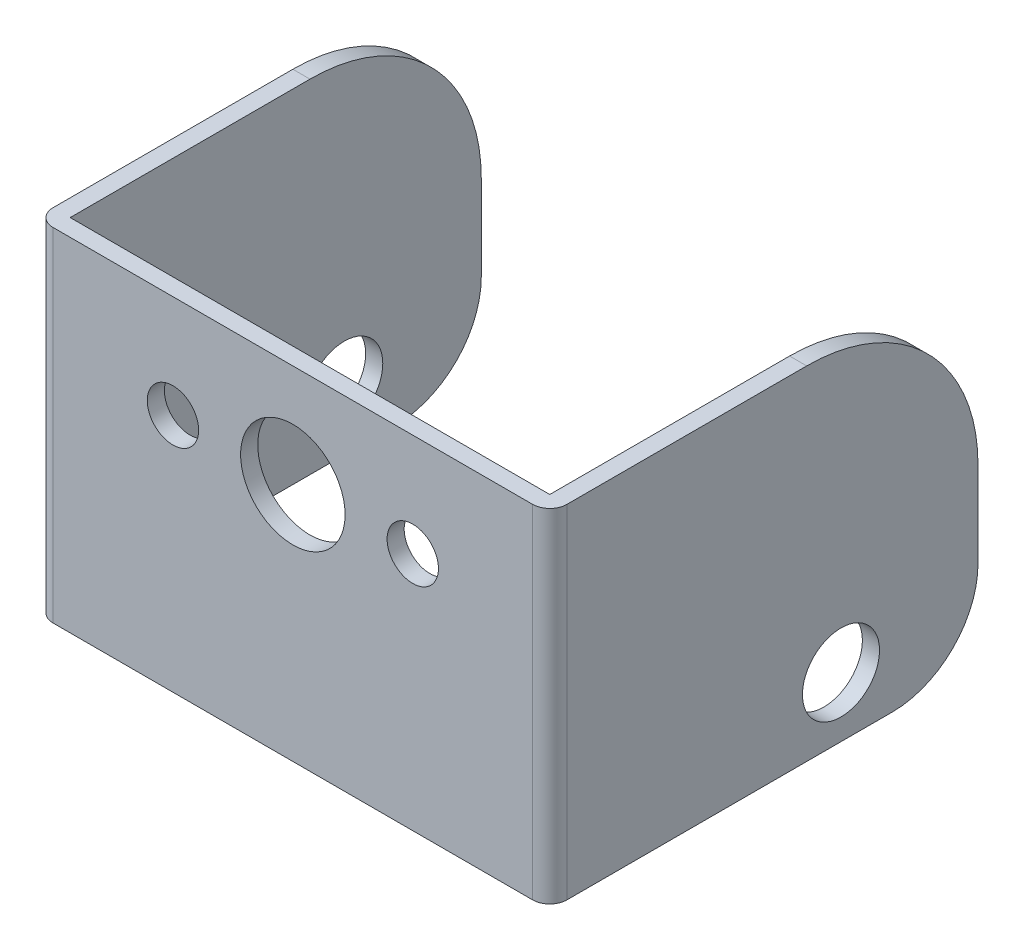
ISO-10303-21;
HEADER;
FILE_DESCRIPTION(('STEP AP214'),'2;1');
FILE_NAME('part.step','',(''),(''),'','','');
FILE_SCHEMA(('AUTOMOTIVE_DESIGN { 1 0 10303 214 1 1 1 1 }'));
ENDSEC;
DATA;
#1=APPLICATION_CONTEXT('core data for automotive mechanical design processes');
#2=APPLICATION_PROTOCOL_DEFINITION('international standard','automotive_design',2000,#1);
#3=PRODUCT_CONTEXT('',#1,'mechanical');
#4=PRODUCT('Part','Part','',(#3));
#5=PRODUCT_RELATED_PRODUCT_CATEGORY('part','',(#4));
#6=PRODUCT_DEFINITION_FORMATION('','',#4);
#7=PRODUCT_DEFINITION_CONTEXT('part definition',#1,'design');
#8=PRODUCT_DEFINITION('design','',#6,#7);
#9=PRODUCT_DEFINITION_SHAPE('','',#8);
#10=(LENGTH_UNIT() NAMED_UNIT(*) SI_UNIT(.MILLI.,.METRE.));
#11=(NAMED_UNIT(*) PLANE_ANGLE_UNIT() SI_UNIT($,.RADIAN.));
#12=(NAMED_UNIT(*) SI_UNIT($,.STERADIAN.) SOLID_ANGLE_UNIT());
#13=UNCERTAINTY_MEASURE_WITH_UNIT(LENGTH_MEASURE(1.E-05),#10,'distance_accuracy_value','');
#14=(GEOMETRIC_REPRESENTATION_CONTEXT(3) GLOBAL_UNCERTAINTY_ASSIGNED_CONTEXT((#13)) GLOBAL_UNIT_ASSIGNED_CONTEXT((#10,
#11,#12)) REPRESENTATION_CONTEXT('',''));
#15=CARTESIAN_POINT('',(0.,0.,0.));
#16=DIRECTION('',(0.,0.,1.));
#17=DIRECTION('',(1.,0.,0.));
#18=AXIS2_PLACEMENT_3D('',#15,#16,#17);
#19=CARTESIAN_POINT('',(0.,20.,-25.));
#20=DIRECTION('',(1.,0.,0.));
#21=DIRECTION('',(0.,0.,-1.));
#22=AXIS2_PLACEMENT_3D('',#19,#20,#21);
#23=PLANE('',#22);
#24=CARTESIAN_POINT('',(0.,3.5,-17.));
#25=DIRECTION('',(1.,0.,0.));
#26=DIRECTION('',(0.,0.,-1.));
#27=AXIS2_PLACEMENT_3D('',#24,#25,#26);
#28=CIRCLE('',#27,2.25);
#29=CARTESIAN_POINT('',(0.,3.5,-19.25));
#30=VERTEX_POINT('',#29);
#31=EDGE_CURVE('E205',#30,#30,#28,.T.);
#32=ORIENTED_EDGE('',*,*,#31,.T.);
#33=EDGE_LOOP('',(#32));
#34=FACE_BOUND('',#33,.T.);
#35=DIRECTION('',(0.,-1.,0.));
#36=VECTOR('',#35,1.);
#37=CARTESIAN_POINT('',(0.,20.,-25.));
#38=LINE('',#37,#36);
#39=CARTESIAN_POINT('',(0.,10.,-25.));
#40=VERTEX_POINT('',#39);
#41=CARTESIAN_POINT('',(0.,5.,-25.));
#42=VERTEX_POINT('',#41);
#43=EDGE_CURVE('E161',#40,#42,#38,.T.);
#44=ORIENTED_EDGE('',*,*,#43,.T.);
#45=CARTESIAN_POINT('',(0.,5.,-20.));
#46=DIRECTION('',(1.,0.,0.));
#47=DIRECTION('',(0.,0.,-1.));
#48=AXIS2_PLACEMENT_3D('',#45,#46,#47);
#49=CIRCLE('',#48,5.);
#50=CARTESIAN_POINT('',(0.,0.,-20.));
#51=VERTEX_POINT('',#50);
#52=EDGE_CURVE('E244',#42,#51,#49,.F.);
#53=ORIENTED_EDGE('',*,*,#52,.T.);
#54=DIRECTION('',(0.,0.,1.));
#55=VECTOR('',#54,1.);
#56=CARTESIAN_POINT('',(0.,0.,-25.));
#57=LINE('',#56,#55);
#58=CARTESIAN_POINT('',(0.,0.,-1.));
#59=VERTEX_POINT('',#58);
#60=EDGE_CURVE('E165',#51,#59,#57,.T.);
#61=ORIENTED_EDGE('',*,*,#60,.T.);
#62=DIRECTION('',(0.,-1.,0.));
#63=VECTOR('',#62,1.);
#64=CARTESIAN_POINT('',(0.,20.,-1.));
#65=LINE('',#64,#63);
#66=CARTESIAN_POINT('',(0.,20.,-1.));
#67=VERTEX_POINT('',#66);
#68=EDGE_CURVE('E222',#59,#67,#65,.F.);
#69=ORIENTED_EDGE('',*,*,#68,.T.);
#70=DIRECTION('',(0.,0.,1.));
#71=VECTOR('',#70,1.);
#72=CARTESIAN_POINT('',(0.,20.,-25.));
#73=LINE('',#72,#71);
#74=CARTESIAN_POINT('',(0.,20.,-15.));
#75=VERTEX_POINT('',#74);
#76=EDGE_CURVE('E179',#75,#67,#73,.T.);
#77=ORIENTED_EDGE('',*,*,#76,.F.);
#78=CARTESIAN_POINT('',(0.,10.,-15.));
#79=DIRECTION('',(1.,0.,0.));
#80=DIRECTION('',(0.,0.,-1.));
#81=AXIS2_PLACEMENT_3D('',#78,#79,#80);
#82=CIRCLE('',#81,10.);
#83=EDGE_CURVE('E235',#75,#40,#82,.F.);
#84=ORIENTED_EDGE('',*,*,#83,.T.);
#85=EDGE_LOOP('',(#44,#53,#61,#69,#77,#84));
#86=FACE_BOUND('',#85,.T.);
#87=ADVANCED_FACE('F31',(#34,#86),#23,.F.);
#88=CARTESIAN_POINT('',(0.,20.,0.));
#89=DIRECTION('',(0.,0.,-1.));
#90=DIRECTION('',(-1.,0.,0.));
#91=AXIS2_PLACEMENT_3D('',#88,#89,#90);
#92=PLANE('',#91);
#93=CARTESIAN_POINT('',(8.,14.,0.));
#94=DIRECTION('',(0.,0.,1.));
#95=DIRECTION('',(1.,0.,0.));
#96=AXIS2_PLACEMENT_3D('',#93,#94,#95);
#97=CIRCLE('',#96,1.5);
#98=CARTESIAN_POINT('',(9.5,14.,0.));
#99=VERTEX_POINT('',#98);
#100=EDGE_CURVE('E200',#99,#99,#97,.T.);
#101=ORIENTED_EDGE('',*,*,#100,.F.);
#102=EDGE_LOOP('',(#101));
#103=FACE_BOUND('',#102,.T.);
#104=CARTESIAN_POINT('',(22.,14.,0.));
#105=DIRECTION('',(0.,0.,1.));
#106=DIRECTION('',(1.,0.,0.));
#107=AXIS2_PLACEMENT_3D('',#104,#105,#106);
#108=CIRCLE('',#107,1.5);
#109=CARTESIAN_POINT('',(23.5,14.,0.));
#110=VERTEX_POINT('',#109);
#111=EDGE_CURVE('E196',#110,#110,#108,.T.);
#112=ORIENTED_EDGE('',*,*,#111,.F.);
#113=EDGE_LOOP('',(#112));
#114=FACE_BOUND('',#113,.T.);
#115=CARTESIAN_POINT('',(15.,14.,0.));
#116=DIRECTION('',(0.,0.,1.));
#117=DIRECTION('',(1.,0.,0.));
#118=AXIS2_PLACEMENT_3D('',#115,#116,#117);
#119=CIRCLE('',#118,3.05);
#120=CARTESIAN_POINT('',(18.05,14.,0.));
#121=VERTEX_POINT('',#120);
#122=EDGE_CURVE('E192',#121,#121,#119,.T.);
#123=ORIENTED_EDGE('',*,*,#122,.F.);
#124=EDGE_LOOP('',(#123));
#125=FACE_BOUND('',#124,.T.);
#126=DIRECTION('',(1.,0.,0.));
#127=VECTOR('',#126,1.);
#128=CARTESIAN_POINT('',(0.,0.,0.));
#129=LINE('',#128,#127);
#130=CARTESIAN_POINT('',(1.,0.,0.));
#131=VERTEX_POINT('',#130);
#132=CARTESIAN_POINT('',(29.,0.,0.));
#133=VERTEX_POINT('',#132);
#134=EDGE_CURVE('E167',#131,#133,#129,.T.);
#135=ORIENTED_EDGE('',*,*,#134,.T.);
#136=DIRECTION('',(0.,-1.,0.));
#137=VECTOR('',#136,1.);
#138=CARTESIAN_POINT('',(29.,20.,0.));
#139=LINE('',#138,#137);
#140=CARTESIAN_POINT('',(29.,20.,0.));
#141=VERTEX_POINT('',#140);
#142=EDGE_CURVE('E216',#133,#141,#139,.F.);
#143=ORIENTED_EDGE('',*,*,#142,.T.);
#144=DIRECTION('',(1.,0.,0.));
#145=VECTOR('',#144,1.);
#146=CARTESIAN_POINT('',(0.,20.,0.));
#147=LINE('',#146,#145);
#148=CARTESIAN_POINT('',(1.,20.,0.));
#149=VERTEX_POINT('',#148);
#150=EDGE_CURVE('E308',#149,#141,#147,.T.);
#151=ORIENTED_EDGE('',*,*,#150,.F.);
#152=DIRECTION('',(0.,-1.,0.));
#153=VECTOR('',#152,1.);
#154=CARTESIAN_POINT('',(1.,20.,0.));
#155=LINE('',#154,#153);
#156=EDGE_CURVE('E213',#149,#131,#155,.T.);
#157=ORIENTED_EDGE('',*,*,#156,.T.);
#158=EDGE_LOOP('',(#135,#143,#151,#157));
#159=FACE_BOUND('',#158,.T.);
#160=ADVANCED_FACE('F282',(#103,#114,#125,#159),#92,.F.);
#161=CARTESIAN_POINT('',(30.,20.,0.));
#162=DIRECTION('',(-1.,0.,0.));
#163=DIRECTION('',(0.,0.,1.));
#164=AXIS2_PLACEMENT_3D('',#161,#162,#163);
#165=PLANE('',#164);
#166=CARTESIAN_POINT('',(30.,3.5,-17.));
#167=DIRECTION('',(1.,0.,0.));
#168=DIRECTION('',(0.,0.,-1.));
#169=AXIS2_PLACEMENT_3D('',#166,#167,#168);
#170=CIRCLE('',#169,2.25);
#171=CARTESIAN_POINT('',(30.,3.5,-19.25));
#172=VERTEX_POINT('',#171);
#173=EDGE_CURVE('E320',#172,#172,#170,.T.);
#174=ORIENTED_EDGE('',*,*,#173,.F.);
#175=EDGE_LOOP('',(#174));
#176=FACE_BOUND('',#175,.T.);
#177=DIRECTION('',(0.,0.,-1.));
#178=VECTOR('',#177,1.);
#179=CARTESIAN_POINT('',(30.,0.,0.));
#180=LINE('',#179,#178);
#181=CARTESIAN_POINT('',(30.,0.,-1.));
#182=VERTEX_POINT('',#181);
#183=CARTESIAN_POINT('',(30.,0.,-20.));
#184=VERTEX_POINT('',#183);
#185=EDGE_CURVE('E171',#182,#184,#180,.T.);
#186=ORIENTED_EDGE('',*,*,#185,.T.);
#187=CARTESIAN_POINT('',(30.,5.,-20.));
#188=DIRECTION('',(-1.,0.,0.));
#189=DIRECTION('',(0.,0.,1.));
#190=AXIS2_PLACEMENT_3D('',#187,#188,#189);
#191=CIRCLE('',#190,5.);
#192=CARTESIAN_POINT('',(30.,5.,-25.));
#193=VERTEX_POINT('',#192);
#194=EDGE_CURVE('E11',#184,#193,#191,.F.);
#195=ORIENTED_EDGE('',*,*,#194,.T.);
#196=DIRECTION('',(0.,-1.,0.));
#197=VECTOR('',#196,1.);
#198=CARTESIAN_POINT('',(30.,20.,-25.));
#199=LINE('',#198,#197);
#200=CARTESIAN_POINT('',(30.,10.,-25.));
#201=VERTEX_POINT('',#200);
#202=EDGE_CURVE('E187',#201,#193,#199,.T.);
#203=ORIENTED_EDGE('',*,*,#202,.F.);
#204=CARTESIAN_POINT('',(30.,10.,-15.));
#205=DIRECTION('',(-1.,0.,0.));
#206=DIRECTION('',(0.,0.,1.));
#207=AXIS2_PLACEMENT_3D('',#204,#205,#206);
#208=CIRCLE('',#207,10.);
#209=CARTESIAN_POINT('',(30.,20.,-15.));
#210=VERTEX_POINT('',#209);
#211=EDGE_CURVE('E233',#201,#210,#208,.F.);
#212=ORIENTED_EDGE('',*,*,#211,.T.);
#213=DIRECTION('',(0.,0.,-1.));
#214=VECTOR('',#213,1.);
#215=CARTESIAN_POINT('',(30.,20.,0.));
#216=LINE('',#215,#214);
#217=CARTESIAN_POINT('',(30.,20.,-1.));
#218=VERTEX_POINT('',#217);
#219=EDGE_CURVE('E143',#218,#210,#216,.T.);
#220=ORIENTED_EDGE('',*,*,#219,.F.);
#221=DIRECTION('',(0.,-1.,0.));
#222=VECTOR('',#221,1.);
#223=CARTESIAN_POINT('',(30.,20.,-1.));
#224=LINE('',#223,#222);
#225=EDGE_CURVE('E189',#218,#182,#224,.T.);
#226=ORIENTED_EDGE('',*,*,#225,.T.);
#227=EDGE_LOOP('',(#186,#195,#203,#212,#220,#226));
#228=FACE_BOUND('',#227,.T.);
#229=ADVANCED_FACE('F263',(#176,#228),#165,.F.);
#230=CARTESIAN_POINT('',(30.,20.,-25.));
#231=DIRECTION('',(0.,0.,1.));
#232=DIRECTION('',(1.,0.,0.));
#233=AXIS2_PLACEMENT_3D('',#230,#231,#232);
#234=PLANE('',#233);
#235=ORIENTED_EDGE('',*,*,#202,.T.);
#236=DIRECTION('',(-1.,0.,0.));
#237=VECTOR('',#236,1.);
#238=CARTESIAN_POINT('',(30.,5.,-25.));
#239=LINE('',#238,#237);
#240=CARTESIAN_POINT('',(29.,5.,-25.));
#241=VERTEX_POINT('',#240);
#242=EDGE_CURVE('E252',#193,#241,#239,.T.);
#243=ORIENTED_EDGE('',*,*,#242,.T.);
#244=DIRECTION('',(0.,-1.,0.));
#245=VECTOR('',#244,1.);
#246=CARTESIAN_POINT('',(29.,20.,-25.));
#247=LINE('',#246,#245);
#248=CARTESIAN_POINT('',(29.,10.,-25.));
#249=VERTEX_POINT('',#248);
#250=EDGE_CURVE('E153',#249,#241,#247,.T.);
#251=ORIENTED_EDGE('',*,*,#250,.F.);
#252=DIRECTION('',(-1.,0.,0.));
#253=VECTOR('',#252,1.);
#254=CARTESIAN_POINT('',(30.,10.,-25.));
#255=LINE('',#254,#253);
#256=EDGE_CURVE('E231',#249,#201,#255,.F.);
#257=ORIENTED_EDGE('',*,*,#256,.T.);
#258=EDGE_LOOP('',(#235,#243,#251,#257));
#259=FACE_BOUND('',#258,.T.);
#260=ADVANCED_FACE('F260',(#259),#234,.F.);
#261=CARTESIAN_POINT('',(29.,20.,-25.));
#262=DIRECTION('',(1.,0.,0.));
#263=DIRECTION('',(0.,0.,-1.));
#264=AXIS2_PLACEMENT_3D('',#261,#262,#263);
#265=PLANE('',#264);
#266=CARTESIAN_POINT('',(29.,3.5,-17.));
#267=DIRECTION('',(1.,0.,0.));
#268=DIRECTION('',(0.,0.,-1.));
#269=AXIS2_PLACEMENT_3D('',#266,#267,#268);
#270=CIRCLE('',#269,2.25);
#271=CARTESIAN_POINT('',(29.,3.5,-19.25));
#272=VERTEX_POINT('',#271);
#273=EDGE_CURVE('E204',#272,#272,#270,.T.);
#274=ORIENTED_EDGE('',*,*,#273,.T.);
#275=EDGE_LOOP('',(#274));
#276=FACE_BOUND('',#275,.T.);
#277=ORIENTED_EDGE('',*,*,#250,.T.);
#278=CARTESIAN_POINT('',(29.,5.,-20.));
#279=DIRECTION('',(1.,0.,0.));
#280=DIRECTION('',(0.,0.,-1.));
#281=AXIS2_PLACEMENT_3D('',#278,#279,#280);
#282=CIRCLE('',#281,5.);
#283=CARTESIAN_POINT('',(29.,0.,-20.));
#284=VERTEX_POINT('',#283);
#285=EDGE_CURVE('E39',#241,#284,#282,.F.);
#286=ORIENTED_EDGE('',*,*,#285,.T.);
#287=DIRECTION('',(0.,0.,1.));
#288=VECTOR('',#287,1.);
#289=CARTESIAN_POINT('',(29.,0.,-25.));
#290=LINE('',#289,#288);
#291=CARTESIAN_POINT('',(29.,0.,-0.999999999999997));
#292=VERTEX_POINT('',#291);
#293=EDGE_CURVE('E150',#284,#292,#290,.T.);
#294=ORIENTED_EDGE('',*,*,#293,.T.);
#295=DIRECTION('',(0.,-1.,0.));
#296=VECTOR('',#295,1.);
#297=CARTESIAN_POINT('',(29.,20.,-0.999999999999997));
#298=LINE('',#297,#296);
#299=CARTESIAN_POINT('',(29.,20.,-0.999999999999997));
#300=VERTEX_POINT('',#299);
#301=EDGE_CURVE('E146',#300,#292,#298,.T.);
#302=ORIENTED_EDGE('',*,*,#301,.F.);
#303=DIRECTION('',(0.,0.,1.));
#304=VECTOR('',#303,1.);
#305=CARTESIAN_POINT('',(29.,20.,-25.));
#306=LINE('',#305,#304);
#307=CARTESIAN_POINT('',(29.,20.,-15.));
#308=VERTEX_POINT('',#307);
#309=EDGE_CURVE('E132',#308,#300,#306,.T.);
#310=ORIENTED_EDGE('',*,*,#309,.F.);
#311=CARTESIAN_POINT('',(29.,10.,-15.));
#312=DIRECTION('',(1.,0.,0.));
#313=DIRECTION('',(0.,0.,-1.));
#314=AXIS2_PLACEMENT_3D('',#311,#312,#313);
#315=CIRCLE('',#314,10.);
#316=EDGE_CURVE('E229',#308,#249,#315,.F.);
#317=ORIENTED_EDGE('',*,*,#316,.T.);
#318=EDGE_LOOP('',(#277,#286,#294,#302,#310,#317));
#319=FACE_BOUND('',#318,.T.);
#320=ADVANCED_FACE('F148',(#276,#319),#265,.F.);
#321=CARTESIAN_POINT('',(29.,20.,-0.999999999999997));
#322=DIRECTION('',(0.,0.,1.));
#323=DIRECTION('',(1.,0.,0.));
#324=AXIS2_PLACEMENT_3D('',#321,#322,#323);
#325=PLANE('',#324);
#326=CARTESIAN_POINT('',(8.,14.,-0.999999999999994));
#327=DIRECTION('',(0.,0.,1.));
#328=DIRECTION('',(1.,0.,0.));
#329=AXIS2_PLACEMENT_3D('',#326,#327,#328);
#330=CIRCLE('',#329,1.5);
#331=CARTESIAN_POINT('',(9.5,14.,-0.999999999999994));
#332=VERTEX_POINT('',#331);
#333=EDGE_CURVE('E197',#332,#332,#330,.T.);
#334=ORIENTED_EDGE('',*,*,#333,.T.);
#335=EDGE_LOOP('',(#334));
#336=FACE_BOUND('',#335,.T.);
#337=CARTESIAN_POINT('',(22.,14.,-0.999999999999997));
#338=DIRECTION('',(0.,0.,1.));
#339=DIRECTION('',(1.,0.,0.));
#340=AXIS2_PLACEMENT_3D('',#337,#338,#339);
#341=CIRCLE('',#340,1.5);
#342=CARTESIAN_POINT('',(23.5,14.,-0.999999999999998));
#343=VERTEX_POINT('',#342);
#344=EDGE_CURVE('E193',#343,#343,#341,.T.);
#345=ORIENTED_EDGE('',*,*,#344,.T.);
#346=EDGE_LOOP('',(#345));
#347=FACE_BOUND('',#346,.T.);
#348=CARTESIAN_POINT('',(15.,14.,-0.999999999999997));
#349=DIRECTION('',(0.,0.,1.));
#350=DIRECTION('',(1.,0.,0.));
#351=AXIS2_PLACEMENT_3D('',#348,#349,#350);
#352=CIRCLE('',#351,3.05);
#353=CARTESIAN_POINT('',(18.05,14.,-0.999999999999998));
#354=VERTEX_POINT('',#353);
#355=EDGE_CURVE('E168',#354,#354,#352,.T.);
#356=ORIENTED_EDGE('',*,*,#355,.T.);
#357=EDGE_LOOP('',(#356));
#358=FACE_BOUND('',#357,.T.);
#359=DIRECTION('',(-1.,0.,0.));
#360=VECTOR('',#359,1.);
#361=CARTESIAN_POINT('',(29.,0.,-0.999999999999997));
#362=LINE('',#361,#360);
#363=CARTESIAN_POINT('',(1.,0.,-0.999999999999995));
#364=VERTEX_POINT('',#363);
#365=EDGE_CURVE('E174',#292,#364,#362,.T.);
#366=ORIENTED_EDGE('',*,*,#365,.T.);
#367=DIRECTION('',(0.,-1.,0.));
#368=VECTOR('',#367,1.);
#369=CARTESIAN_POINT('',(1.,20.,-0.999999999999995));
#370=LINE('',#369,#368);
#371=CARTESIAN_POINT('',(1.,20.,-0.999999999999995));
#372=VERTEX_POINT('',#371);
#373=EDGE_CURVE('E154',#372,#364,#370,.T.);
#374=ORIENTED_EDGE('',*,*,#373,.F.);
#375=DIRECTION('',(-1.,0.,0.));
#376=VECTOR('',#375,1.);
#377=CARTESIAN_POINT('',(29.,20.,-0.999999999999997));
#378=LINE('',#377,#376);
#379=EDGE_CURVE('E138',#300,#372,#378,.T.);
#380=ORIENTED_EDGE('',*,*,#379,.F.);
#381=ORIENTED_EDGE('',*,*,#301,.T.);
#382=EDGE_LOOP('',(#366,#374,#380,#381));
#383=FACE_BOUND('',#382,.T.);
#384=ADVANCED_FACE('F156',(#336,#347,#358,#383),#325,.F.);
#385=CARTESIAN_POINT('',(1.,20.,-0.999999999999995));
#386=DIRECTION('',(-1.,0.,0.));
#387=DIRECTION('',(0.,0.,1.));
#388=AXIS2_PLACEMENT_3D('',#385,#386,#387);
#389=PLANE('',#388);
#390=CARTESIAN_POINT('',(1.,3.5,-17.));
#391=DIRECTION('',(-1.,0.,0.));
#392=DIRECTION('',(0.,0.,1.));
#393=AXIS2_PLACEMENT_3D('',#390,#391,#392);
#394=CIRCLE('',#393,2.25);
#395=CARTESIAN_POINT('',(1.,3.5,-14.75));
#396=VERTEX_POINT('',#395);
#397=EDGE_CURVE('E201',#396,#396,#394,.T.);
#398=ORIENTED_EDGE('',*,*,#397,.T.);
#399=EDGE_LOOP('',(#398));
#400=FACE_BOUND('',#399,.T.);
#401=DIRECTION('',(0.,0.,-1.));
#402=VECTOR('',#401,1.);
#403=CARTESIAN_POINT('',(1.,0.,-0.999999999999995));
#404=LINE('',#403,#402);
#405=CARTESIAN_POINT('',(1.,0.,-20.));
#406=VERTEX_POINT('',#405);
#407=EDGE_CURVE('E176',#364,#406,#404,.T.);
#408=ORIENTED_EDGE('',*,*,#407,.T.);
#409=CARTESIAN_POINT('',(1.,5.,-20.));
#410=DIRECTION('',(-1.,0.,0.));
#411=DIRECTION('',(0.,0.,1.));
#412=AXIS2_PLACEMENT_3D('',#409,#410,#411);
#413=CIRCLE('',#412,5.);
#414=CARTESIAN_POINT('',(1.,5.,-25.));
#415=VERTEX_POINT('',#414);
#416=EDGE_CURVE('E250',#406,#415,#413,.F.);
#417=ORIENTED_EDGE('',*,*,#416,.T.);
#418=DIRECTION('',(0.,-1.,0.));
#419=VECTOR('',#418,1.);
#420=CARTESIAN_POINT('',(1.,20.,-25.));
#421=LINE('',#420,#419);
#422=CARTESIAN_POINT('',(1.,10.,-25.));
#423=VERTEX_POINT('',#422);
#424=EDGE_CURVE('E182',#423,#415,#421,.T.);
#425=ORIENTED_EDGE('',*,*,#424,.F.);
#426=CARTESIAN_POINT('',(1.,10.,-15.));
#427=DIRECTION('',(-1.,0.,0.));
#428=DIRECTION('',(0.,0.,1.));
#429=AXIS2_PLACEMENT_3D('',#426,#427,#428);
#430=CIRCLE('',#429,10.);
#431=CARTESIAN_POINT('',(1.,20.,-15.));
#432=VERTEX_POINT('',#431);
#433=EDGE_CURVE('E239',#423,#432,#430,.F.);
#434=ORIENTED_EDGE('',*,*,#433,.T.);
#435=DIRECTION('',(0.,0.,-1.));
#436=VECTOR('',#435,1.);
#437=CARTESIAN_POINT('',(1.,20.,-0.999999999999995));
#438=LINE('',#437,#436);
#439=EDGE_CURVE('E159',#372,#432,#438,.T.);
#440=ORIENTED_EDGE('',*,*,#439,.F.);
#441=ORIENTED_EDGE('',*,*,#373,.T.);
#442=EDGE_LOOP('',(#408,#417,#425,#434,#440,#441));
#443=FACE_BOUND('',#442,.T.);
#444=ADVANCED_FACE('F330',(#400,#443),#389,.F.);
#445=CARTESIAN_POINT('',(1.,20.,-25.));
#446=DIRECTION('',(0.,0.,1.));
#447=DIRECTION('',(1.,0.,0.));
#448=AXIS2_PLACEMENT_3D('',#445,#446,#447);
#449=PLANE('',#448);
#450=ORIENTED_EDGE('',*,*,#424,.T.);
#451=DIRECTION('',(-1.,0.,0.));
#452=VECTOR('',#451,1.);
#453=CARTESIAN_POINT('',(1.,5.,-25.));
#454=LINE('',#453,#452);
#455=EDGE_CURVE('E241',#415,#42,#454,.T.);
#456=ORIENTED_EDGE('',*,*,#455,.T.);
#457=ORIENTED_EDGE('',*,*,#43,.F.);
#458=DIRECTION('',(-1.,0.,0.));
#459=VECTOR('',#458,1.);
#460=CARTESIAN_POINT('',(1.,10.,-25.));
#461=LINE('',#460,#459);
#462=EDGE_CURVE('E237',#40,#423,#461,.F.);
#463=ORIENTED_EDGE('',*,*,#462,.T.);
#464=EDGE_LOOP('',(#450,#456,#457,#463));
#465=FACE_BOUND('',#464,.T.);
#466=ADVANCED_FACE('F333',(#465),#449,.F.);
#467=CARTESIAN_POINT('',(0.,20.,0.));
#468=DIRECTION('',(0.,1.,0.));
#469=DIRECTION('',(0.,0.,1.));
#470=AXIS2_PLACEMENT_3D('',#467,#468,#469);
#471=PLANE('',#470);
#472=ORIENTED_EDGE('',*,*,#219,.T.);
#473=DIRECTION('',(-1.,0.,0.));
#474=VECTOR('',#473,1.);
#475=CARTESIAN_POINT('',(29.,20.,-15.));
#476=LINE('',#475,#474);
#477=EDGE_CURVE('E141',#210,#308,#476,.T.);
#478=ORIENTED_EDGE('',*,*,#477,.T.);
#479=ORIENTED_EDGE('',*,*,#309,.T.);
#480=ORIENTED_EDGE('',*,*,#379,.T.);
#481=ORIENTED_EDGE('',*,*,#439,.T.);
#482=DIRECTION('',(-1.,0.,0.));
#483=VECTOR('',#482,1.);
#484=CARTESIAN_POINT('',(0.,20.,-15.));
#485=LINE('',#484,#483);
#486=EDGE_CURVE('E225',#432,#75,#485,.T.);
#487=ORIENTED_EDGE('',*,*,#486,.T.);
#488=ORIENTED_EDGE('',*,*,#76,.T.);
#489=CARTESIAN_POINT('',(1.,20.,-1.));
#490=DIRECTION('',(0.,1.,0.));
#491=DIRECTION('',(0.,0.,1.));
#492=AXIS2_PLACEMENT_3D('',#489,#490,#491);
#493=CIRCLE('',#492,1.);
#494=EDGE_CURVE('E218',#67,#149,#493,.T.);
#495=ORIENTED_EDGE('',*,*,#494,.T.);
#496=ORIENTED_EDGE('',*,*,#150,.T.);
#497=CARTESIAN_POINT('',(29.,20.,-1.));
#498=DIRECTION('',(0.,1.,0.));
#499=DIRECTION('',(0.,0.,1.));
#500=AXIS2_PLACEMENT_3D('',#497,#498,#499);
#501=CIRCLE('',#500,1.);
#502=EDGE_CURVE('E220',#141,#218,#501,.T.);
#503=ORIENTED_EDGE('',*,*,#502,.T.);
#504=EDGE_LOOP('',(#472,#478,#479,#480,#481,#487,#488,#495,#496,#503));
#505=FACE_BOUND('',#504,.T.);
#506=ADVANCED_FACE('F135',(#505),#471,.T.);
#507=CARTESIAN_POINT('',(0.,0.,0.));
#508=DIRECTION('',(0.,1.,0.));
#509=DIRECTION('',(0.,0.,1.));
#510=AXIS2_PLACEMENT_3D('',#507,#508,#509);
#511=PLANE('',#510);
#512=ORIENTED_EDGE('',*,*,#60,.F.);
#513=DIRECTION('',(-1.,0.,0.));
#514=VECTOR('',#513,1.);
#515=CARTESIAN_POINT('',(0.,0.,-20.));
#516=LINE('',#515,#514);
#517=EDGE_CURVE('E248',#51,#406,#516,.F.);
#518=ORIENTED_EDGE('',*,*,#517,.T.);
#519=ORIENTED_EDGE('',*,*,#407,.F.);
#520=ORIENTED_EDGE('',*,*,#365,.F.);
#521=ORIENTED_EDGE('',*,*,#293,.F.);
#522=DIRECTION('',(-1.,0.,0.));
#523=VECTOR('',#522,1.);
#524=CARTESIAN_POINT('',(0.,0.,-20.));
#525=LINE('',#524,#523);
#526=EDGE_CURVE('E246',#284,#184,#525,.F.);
#527=ORIENTED_EDGE('',*,*,#526,.T.);
#528=ORIENTED_EDGE('',*,*,#185,.F.);
#529=CARTESIAN_POINT('',(29.,0.,-1.));
#530=DIRECTION('',(0.,1.,0.));
#531=DIRECTION('',(0.,0.,1.));
#532=AXIS2_PLACEMENT_3D('',#529,#530,#531);
#533=CIRCLE('',#532,1.);
#534=EDGE_CURVE('E211',#182,#133,#533,.F.);
#535=ORIENTED_EDGE('',*,*,#534,.T.);
#536=ORIENTED_EDGE('',*,*,#134,.F.);
#537=CARTESIAN_POINT('',(1.,0.,-1.));
#538=DIRECTION('',(0.,1.,0.));
#539=DIRECTION('',(0.,0.,1.));
#540=AXIS2_PLACEMENT_3D('',#537,#538,#539);
#541=CIRCLE('',#540,1.);
#542=EDGE_CURVE('E208',#131,#59,#541,.F.);
#543=ORIENTED_EDGE('',*,*,#542,.T.);
#544=EDGE_LOOP('',(#512,#518,#519,#520,#521,#527,#528,#535,#536,#543));
#545=FACE_BOUND('',#544,.T.);
#546=ADVANCED_FACE('F256',(#545),#511,.F.);
#547=CARTESIAN_POINT('',(15.,14.,-25.));
#548=DIRECTION('',(0.,0.,1.));
#549=DIRECTION('',(1.,0.,0.));
#550=AXIS2_PLACEMENT_3D('',#547,#548,#549);
#551=CYLINDRICAL_SURFACE('',#550,3.05);
#552=ORIENTED_EDGE('',*,*,#122,.T.);
#553=EDGE_LOOP('',(#552));
#554=FACE_BOUND('',#553,.T.);
#555=ORIENTED_EDGE('',*,*,#355,.F.);
#556=EDGE_LOOP('',(#555));
#557=FACE_BOUND('',#556,.T.);
#558=ADVANCED_FACE('F406',(#554,#557),#551,.F.);
#559=CARTESIAN_POINT('',(22.,14.,-25.));
#560=DIRECTION('',(0.,0.,1.));
#561=DIRECTION('',(1.,0.,0.));
#562=AXIS2_PLACEMENT_3D('',#559,#560,#561);
#563=CYLINDRICAL_SURFACE('',#562,1.5);
#564=ORIENTED_EDGE('',*,*,#111,.T.);
#565=EDGE_LOOP('',(#564));
#566=FACE_BOUND('',#565,.T.);
#567=ORIENTED_EDGE('',*,*,#344,.F.);
#568=EDGE_LOOP('',(#567));
#569=FACE_BOUND('',#568,.T.);
#570=ADVANCED_FACE('F482',(#566,#569),#563,.F.);
#571=CARTESIAN_POINT('',(8.,14.,-25.));
#572=DIRECTION('',(0.,0.,1.));
#573=DIRECTION('',(1.,0.,0.));
#574=AXIS2_PLACEMENT_3D('',#571,#572,#573);
#575=CYLINDRICAL_SURFACE('',#574,1.5);
#576=ORIENTED_EDGE('',*,*,#100,.T.);
#577=EDGE_LOOP('',(#576));
#578=FACE_BOUND('',#577,.T.);
#579=ORIENTED_EDGE('',*,*,#333,.F.);
#580=EDGE_LOOP('',(#579));
#581=FACE_BOUND('',#580,.T.);
#582=ADVANCED_FACE('F327',(#578,#581),#575,.F.);
#583=CARTESIAN_POINT('',(0.,3.5,-17.));
#584=DIRECTION('',(1.,0.,0.));
#585=DIRECTION('',(0.,0.,-1.));
#586=AXIS2_PLACEMENT_3D('',#583,#584,#585);
#587=CYLINDRICAL_SURFACE('',#586,2.25);
#588=ORIENTED_EDGE('',*,*,#31,.F.);
#589=EDGE_LOOP('',(#588));
#590=FACE_BOUND('',#589,.T.);
#591=ORIENTED_EDGE('',*,*,#397,.F.);
#592=EDGE_LOOP('',(#591));
#593=FACE_BOUND('',#592,.T.);
#594=ADVANCED_FACE('F300',(#590,#593),#587,.F.);
#595=ORIENTED_EDGE('',*,*,#173,.T.);
#596=EDGE_LOOP('',(#595));
#597=FACE_BOUND('',#596,.T.);
#598=ORIENTED_EDGE('',*,*,#273,.F.);
#599=EDGE_LOOP('',(#598));
#600=FACE_BOUND('',#599,.T.);
#601=ADVANCED_FACE('F295',(#597,#600),#587,.F.);
#602=CARTESIAN_POINT('',(29.,20.,-1.));
#603=DIRECTION('',(0.,-1.,0.));
#604=DIRECTION('',(0.,0.,-1.));
#605=AXIS2_PLACEMENT_3D('',#602,#603,#604);
#606=CYLINDRICAL_SURFACE('',#605,1.);
#607=ORIENTED_EDGE('',*,*,#502,.F.);
#608=ORIENTED_EDGE('',*,*,#142,.F.);
#609=ORIENTED_EDGE('',*,*,#534,.F.);
#610=ORIENTED_EDGE('',*,*,#225,.F.);
#611=EDGE_LOOP('',(#607,#608,#609,#610));
#612=FACE_BOUND('',#611,.T.);
#613=ADVANCED_FACE('F278',(#612),#606,.T.);
#614=CARTESIAN_POINT('',(1.,20.,-1.));
#615=DIRECTION('',(0.,-1.,0.));
#616=DIRECTION('',(0.,0.,-1.));
#617=AXIS2_PLACEMENT_3D('',#614,#615,#616);
#618=CYLINDRICAL_SURFACE('',#617,1.);
#619=ORIENTED_EDGE('',*,*,#494,.F.);
#620=ORIENTED_EDGE('',*,*,#68,.F.);
#621=ORIENTED_EDGE('',*,*,#542,.F.);
#622=ORIENTED_EDGE('',*,*,#156,.F.);
#623=EDGE_LOOP('',(#619,#620,#621,#622));
#624=FACE_BOUND('',#623,.T.);
#625=ADVANCED_FACE('F269',(#624),#618,.T.);
#626=CARTESIAN_POINT('',(0.,10.,-15.));
#627=DIRECTION('',(1.,0.,0.));
#628=DIRECTION('',(0.,0.,-1.));
#629=AXIS2_PLACEMENT_3D('',#626,#627,#628);
#630=CYLINDRICAL_SURFACE('',#629,10.);
#631=ORIENTED_EDGE('',*,*,#211,.F.);
#632=ORIENTED_EDGE('',*,*,#256,.F.);
#633=ORIENTED_EDGE('',*,*,#316,.F.);
#634=ORIENTED_EDGE('',*,*,#477,.F.);
#635=EDGE_LOOP('',(#631,#632,#633,#634));
#636=FACE_BOUND('',#635,.T.);
#637=ADVANCED_FACE('F266',(#636),#630,.T.);
#638=CARTESIAN_POINT('',(0.,10.,-15.));
#639=DIRECTION('',(1.,0.,0.));
#640=DIRECTION('',(0.,0.,-1.));
#641=AXIS2_PLACEMENT_3D('',#638,#639,#640);
#642=CYLINDRICAL_SURFACE('',#641,10.);
#643=ORIENTED_EDGE('',*,*,#433,.F.);
#644=ORIENTED_EDGE('',*,*,#462,.F.);
#645=ORIENTED_EDGE('',*,*,#83,.F.);
#646=ORIENTED_EDGE('',*,*,#486,.F.);
#647=EDGE_LOOP('',(#643,#644,#645,#646));
#648=FACE_BOUND('',#647,.T.);
#649=ADVANCED_FACE('F268',(#648),#642,.T.);
#650=CARTESIAN_POINT('',(1.,5.,-20.));
#651=DIRECTION('',(-1.,0.,0.));
#652=DIRECTION('',(0.,0.,1.));
#653=AXIS2_PLACEMENT_3D('',#650,#651,#652);
#654=CYLINDRICAL_SURFACE('',#653,5.);
#655=ORIENTED_EDGE('',*,*,#416,.F.);
#656=ORIENTED_EDGE('',*,*,#517,.F.);
#657=ORIENTED_EDGE('',*,*,#52,.F.);
#658=ORIENTED_EDGE('',*,*,#455,.F.);
#659=EDGE_LOOP('',(#655,#656,#657,#658));
#660=FACE_BOUND('',#659,.T.);
#661=ADVANCED_FACE('F275',(#660),#654,.T.);
#662=CARTESIAN_POINT('',(30.,5.,-20.));
#663=DIRECTION('',(-1.,0.,0.));
#664=DIRECTION('',(0.,0.,1.));
#665=AXIS2_PLACEMENT_3D('',#662,#663,#664);
#666=CYLINDRICAL_SURFACE('',#665,5.);
#667=ORIENTED_EDGE('',*,*,#194,.F.);
#668=ORIENTED_EDGE('',*,*,#526,.F.);
#669=ORIENTED_EDGE('',*,*,#285,.F.);
#670=ORIENTED_EDGE('',*,*,#242,.F.);
#671=EDGE_LOOP('',(#667,#668,#669,#670));
#672=FACE_BOUND('',#671,.T.);
#673=ADVANCED_FACE('F33',(#672),#666,.T.);
#674=CLOSED_SHELL('',(#87,#160,#229,#260,#320,#384,#444,#466,#506,#546,#558,#570,#582,#594,#601,
#613,#625,#637,#649,#661,#673));
#675=MANIFOLD_SOLID_BREP('B2',#674);
#676=ADVANCED_BREP_SHAPE_REPRESENTATION('',(#18,#675),#14);
#677=SHAPE_DEFINITION_REPRESENTATION(#9,#676);
ENDSEC;
END-ISO-10303-21;
